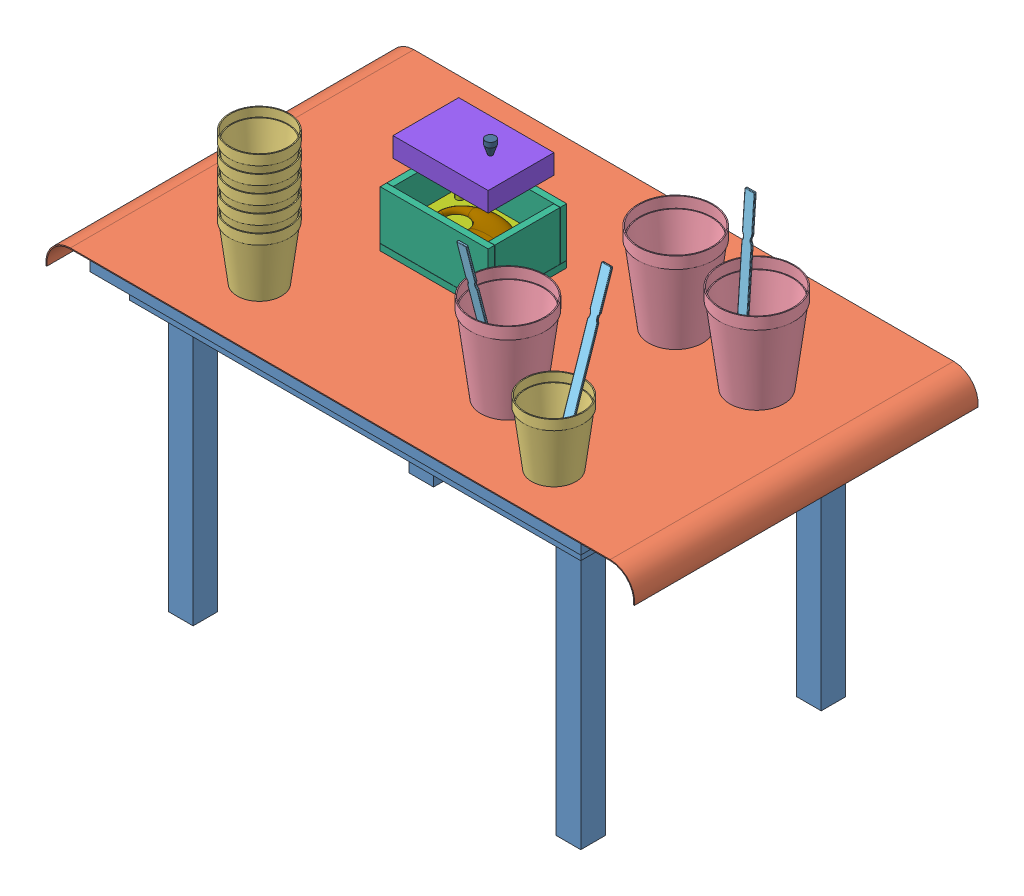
SolidWorks assembly TableSetup.SLDASM, configuration Default (file format 11000). Lengths in mm.
Overall size (1200 958.36 700).
21 component instances, 10 part files, 8 mates.
Components (placement in the parent):
- Table-1: Table.SLDPRT [Default] at origin size (1000 620 700)
- Paper-1: Paper.SLDPRT [Default] at (-0.1092 22 0) size (1200 56.19 700)
- Scup-1: Scup.SLDPRT [Default] at (214.921 22 -130.111) size (121.01 130 121.01)
- Lcup-1: Lcup.SLDPRT [Default] at (907.1007 22 -451.7328) size (152.36 180 152.36)
- Lcup-3: Lcup.SLDPRT [Default] at (670.8742 22 -180.7439) size (152.36 180 152.36)
- Scup-2: Scup.SLDPRT [Default] at (842.4165 22 -102.6954) size (121.01 130 121.01)
- MixingStick-1: MixingStick.SLDPRT [Default] at (886.6239 38.8648 -439.2152) x (1 0 0) z (0 -0.997564 0.069756) size (20 4 320)
- MixingStick-2: MixingStick.SLDPRT [Default] at (664.6743 26.5418 -175.746) x (1 0 0) z (0 -0.968148 -0.25038) size (20 4 320)
- MixingStick-3: MixingStick.SLDPRT [Default] at (841.6378 24.0427 -112.9278) x (1 0 0) z (0 -0.948324 0.317305) size (20 4 320)
- MixingStick-4: MixingStick.SLDPRT [Default] at (1415.2597 131.3497 367.9267) size (20 4 320) (hidden)
- MoldSetup-1: MoldSetup.SLDASM [Default] at (390.941 22 -390.4104) size (220 231.34 160)
  - Sbox2-1: Sbox2.SLDPRT [Default] at origin size (220 113.5 160)
  - DonutMoldA-1: DonutMoldA.SLDPRT [Default] at (0 44.27 0) size (194 42 134)
  - DonutMoldB-1: DonutMoldB.SLDPRT [Default] at (0 163.6049 0) size (194 40 134)
  - Donut-1: Donut.SLDPRT [Default] at (0 44.27 0) size (144 27.59 110.24)
  - Funnel-1: Funnel.SLDPRT [Default] at (35.1735 196.3386 0.4833) size (20 55 20)
- Scup-3: Scup.SLDPRT [Default] at (214.921 57 -130.111) size (121.01 130 121.01)
- Scup-4: Scup.SLDPRT [Default] at (214.921 92 -130.111) size (121.01 130 121.01)
- Scup-5: Scup.SLDPRT [Default] at (214.921 127 -130.111) size (121.01 130 121.01)
- Scup-6: Scup.SLDPRT [Default] at (214.921 162 -130.111) size (121.01 130 121.01)
- Lcup-4: Lcup.SLDPRT [Default] at (717.163 22 -476.2446) size (152.36 180 152.36)
Mates (geometry in assembly coordinates):
- Coincident1: coincident: plane of Table-1 through (0 20 0) normal (0 1 0); plane of Paper-1 through (-40.1092 20 0) normal (0 -1 0)
- Coincident2: coincident: plane of Table-1 through (0 20 -700) normal (0 0 -1); plane of Paper-1 through (1059.8908 -28 -700) normal (0 0 -1)
- Coincident3: coincident: plane of Paper-1 through (-40.1092 22 0) normal (0 1 0); plane of Lcup-1 through (962.1007 22 -451.7328) normal (0 -1 0)
- Coincident4: coincident: plane of Paper-1 through (-40.1092 22 0) normal (0 1 0); plane of Lcup-3 through (725.8742 22 -180.7439) normal (0 -1 0)
- Coincident5: coincident: plane of Paper-1 through (-40.1092 22 0) normal (0 1 0); plane of Scup-1 through (259.921 22 -130.111) normal (0 -1 0)
- Coincident6: coincident: plane of Paper-1 through (-40.1092 22 0) normal (0 1 0); plane of Scup-2 through (887.4165 22 -102.6954) normal (0 -1 0)
- Coincident7: coincident: plane of Paper-1 through (-40.1092 22 0) normal (0 1 0); plane of MoldSetup-1/Sbox2-1 through (390.941 22 -390.4104) normal (0 -1 0)
- Coincident8: coincident: plane of Paper-1 through (-40.1092 22 0) normal (0 1 0); plane of Lcup-4 through (772.163 22 -476.2446) normal (0 -1 0)
